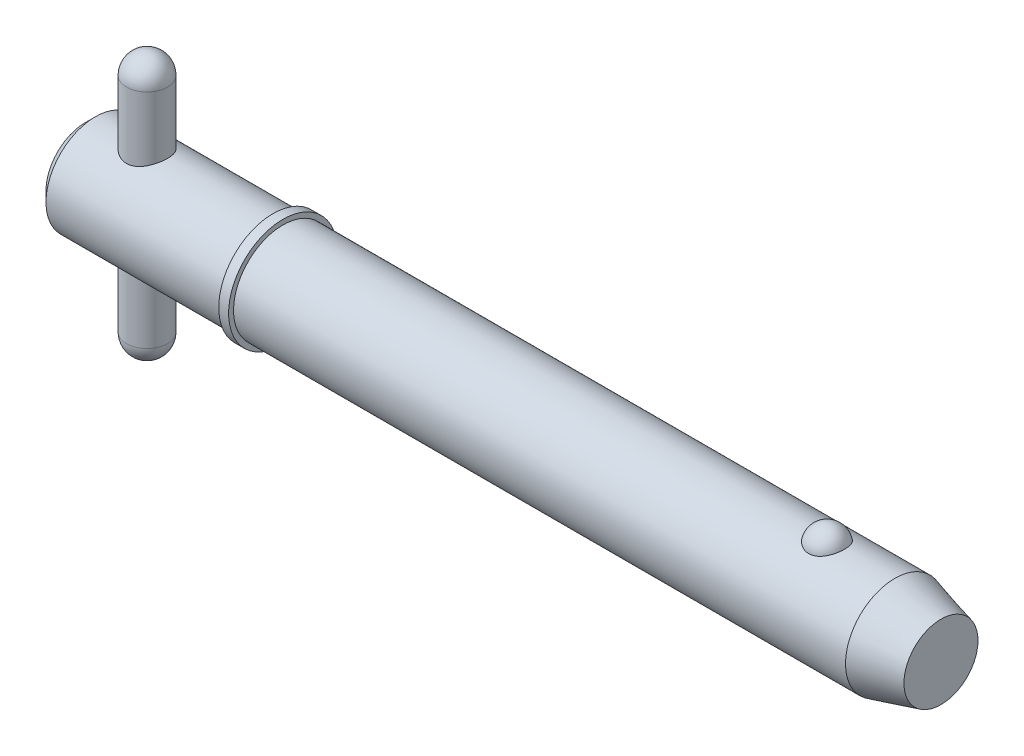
ISO-10303-21;
HEADER;
FILE_DESCRIPTION(('STEP AP214'),'2;1');
FILE_NAME('part.step','',(''),(''),'','','');
FILE_SCHEMA(('AUTOMOTIVE_DESIGN { 1 0 10303 214 1 1 1 1 }'));
ENDSEC;
DATA;
#1=APPLICATION_CONTEXT('core data for automotive mechanical design processes');
#2=APPLICATION_PROTOCOL_DEFINITION('international standard','automotive_design',2000,#1);
#3=PRODUCT_CONTEXT('',#1,'mechanical');
#4=PRODUCT('Part','Part','',(#3));
#5=PRODUCT_RELATED_PRODUCT_CATEGORY('part','',(#4));
#6=PRODUCT_DEFINITION_FORMATION('','',#4);
#7=PRODUCT_DEFINITION_CONTEXT('part definition',#1,'design');
#8=PRODUCT_DEFINITION('design','',#6,#7);
#9=PRODUCT_DEFINITION_SHAPE('','',#8);
#10=(LENGTH_UNIT() NAMED_UNIT(*) SI_UNIT(.MILLI.,.METRE.));
#11=(NAMED_UNIT(*) PLANE_ANGLE_UNIT() SI_UNIT($,.RADIAN.));
#12=(NAMED_UNIT(*) SI_UNIT($,.STERADIAN.) SOLID_ANGLE_UNIT());
#13=UNCERTAINTY_MEASURE_WITH_UNIT(LENGTH_MEASURE(1.E-05),#10,'distance_accuracy_value','');
#14=(GEOMETRIC_REPRESENTATION_CONTEXT(3) GLOBAL_UNCERTAINTY_ASSIGNED_CONTEXT((#13)) GLOBAL_UNIT_ASSIGNED_CONTEXT((#10,
#11,#12)) REPRESENTATION_CONTEXT('',''));
#15=CARTESIAN_POINT('',(0.,0.,0.));
#16=DIRECTION('',(0.,0.,1.));
#17=DIRECTION('',(1.,0.,0.));
#18=AXIS2_PLACEMENT_3D('',#15,#16,#17);
#19=CARTESIAN_POINT('',(5.94,12.7,0.));
#20=DIRECTION('',(0.,-1.,0.));
#21=DIRECTION('',(0.,0.,-1.));
#22=AXIS2_PLACEMENT_3D('',#19,#20,#21);
#23=CYLINDRICAL_SURFACE('',#22,1.98);
#24=CARTESIAN_POINT('',(5.94,-10.72,0.));
#25=DIRECTION('',(0.,-1.,0.));
#26=DIRECTION('',(0.,0.,-1.));
#27=AXIS2_PLACEMENT_3D('',#24,#25,#26);
#28=CIRCLE('',#27,1.98);
#29=CARTESIAN_POINT('',(5.94,-10.72,-1.98));
#30=VERTEX_POINT('',#29);
#31=EDGE_CURVE('P0_E10',#30,#30,#28,.F.);
#32=ORIENTED_EDGE('',*,*,#31,.T.);
#33=EDGE_LOOP('',(#32));
#34=FACE_BOUND('',#33,.T.);
#35=CARTESIAN_POINT('',(5.94,10.72,0.));
#36=DIRECTION('',(0.,-1.,0.));
#37=DIRECTION('',(0.,0.,-1.));
#38=AXIS2_PLACEMENT_3D('',#35,#36,#37);
#39=CIRCLE('',#38,1.98);
#40=CARTESIAN_POINT('',(5.94,10.72,-1.98));
#41=VERTEX_POINT('',#40);
#42=EDGE_CURVE('P0_E21',#41,#41,#39,.T.);
#43=ORIENTED_EDGE('',*,*,#42,.T.);
#44=EDGE_LOOP('',(#43));
#45=FACE_BOUND('',#44,.T.);
#46=ADVANCED_FACE('P0_F14',(#34,#45),#23,.T.);
#47=CARTESIAN_POINT('',(5.94,-10.72,0.));
#48=DIRECTION('',(0.,0.,1.));
#49=DIRECTION('',(1.,0.,0.));
#50=AXIS2_PLACEMENT_3D('',#47,#48,#49);
#51=SPHERICAL_SURFACE('',#50,1.98);
#52=CARTESIAN_POINT('',(5.94,-10.72,0.));
#53=DIRECTION('',(0.,-1.,0.));
#54=DIRECTION('',(0.,0.,-1.));
#55=AXIS2_PLACEMENT_3D('',#52,#53,#54);
#56=SPHERICAL_SURFACE('',#55,1.98);
#57=ORIENTED_EDGE('',*,*,#31,.F.);
#58=EDGE_LOOP('',(#57));
#59=FACE_BOUND('',#58,.T.);
#60=ADVANCED_FACE('P0_F29',(#59),#56,.T.);
#61=CARTESIAN_POINT('',(5.94,10.72,0.));
#62=DIRECTION('',(0.,0.,1.));
#63=DIRECTION('',(1.,0.,0.));
#64=AXIS2_PLACEMENT_3D('',#61,#62,#63);
#65=SPHERICAL_SURFACE('',#64,1.98);
#66=CARTESIAN_POINT('',(5.94,10.72,0.));
#67=DIRECTION('',(0.,-1.,0.));
#68=DIRECTION('',(0.,0.,-1.));
#69=AXIS2_PLACEMENT_3D('',#66,#67,#68);
#70=SPHERICAL_SURFACE('',#69,1.98);
#71=ORIENTED_EDGE('',*,*,#42,.F.);
#72=EDGE_LOOP('',(#71));
#73=FACE_BOUND('',#72,.T.);
#74=ADVANCED_FACE('P0_F16',(#73),#70,.T.);
#75=CLOSED_SHELL('',(#46,#60,#74));
#76=MANIFOLD_SOLID_BREP('P0_B1',#75);
#77=CARTESIAN_POINT('',(0.,0.,0.));
#78=DIRECTION('',(1.,0.,0.));
#79=DIRECTION('',(0.,0.,-1.));
#80=AXIS2_PLACEMENT_3D('',#77,#78,#79);
#81=CYLINDRICAL_SURFACE('',#80,4.765);
#82=CARTESIAN_POINT('',(78.1041944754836,0.,0.));
#83=DIRECTION('',(1.,0.,0.));
#84=DIRECTION('',(0.,0.,-1.));
#85=AXIS2_PLACEMENT_3D('',#82,#83,#84);
#86=CIRCLE('',#85,4.765);
#87=CARTESIAN_POINT('',(78.1041944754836,0.,-4.765));
#88=VERTEX_POINT('',#87);
#89=EDGE_CURVE('P1_E81',#88,#88,#86,.T.);
#90=ORIENTED_EDGE('',*,*,#89,.F.);
#91=EDGE_LOOP('',(#90));
#92=FACE_BOUND('',#91,.T.);
#93=CARTESIAN_POINT('',(19.05,0.,0.));
#94=DIRECTION('',(1.,0.,0.));
#95=DIRECTION('',(0.,0.,-1.));
#96=AXIS2_PLACEMENT_3D('',#93,#94,#95);
#97=CIRCLE('',#96,4.765);
#98=CARTESIAN_POINT('',(19.05,0.,-4.765));
#99=VERTEX_POINT('',#98);
#100=EDGE_CURVE('P1_E85',#99,#99,#97,.T.);
#101=ORIENTED_EDGE('',*,*,#100,.T.);
#102=EDGE_LOOP('',(#101));
#103=FACE_BOUND('',#102,.T.);
#104=CARTESIAN_POINT('',(71.551020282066,4.42764777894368,1.76101111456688));
#105=CARTESIAN_POINT('',(71.4597212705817,4.42764470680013,1.76101422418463));
#106=CARTESIAN_POINT('',(71.3684468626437,4.43059091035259,1.75366340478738));
#107=CARTESIAN_POINT('',(71.188615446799,4.44201846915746,1.72451180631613));
#108=CARTESIAN_POINT('',(71.1000577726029,4.45049845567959,1.70271460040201));
#109=CARTESIAN_POINT('',(70.9282570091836,4.47200516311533,1.6453937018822));
#110=CARTESIAN_POINT('',(70.8450064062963,4.48502527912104,1.60988994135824));
#111=CARTESIAN_POINT('',(70.6857633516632,4.51419542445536,1.52617873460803));
#112=CARTESIAN_POINT('',(70.6097723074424,4.53034605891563,1.47796883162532));
#113=CARTESIAN_POINT('',(70.4647445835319,4.5645931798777,1.36860494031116));
#114=CARTESIAN_POINT('',(70.3959645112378,4.58273170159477,1.30712420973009));
#115=CARTESIAN_POINT('',(70.2693423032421,4.61870302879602,1.17370204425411));
#116=CARTESIAN_POINT('',(70.2115021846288,4.63653577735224,1.1017586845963));
#117=CARTESIAN_POINT('',(70.1055709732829,4.67090140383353,0.945806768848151));
#118=CARTESIAN_POINT('',(70.0580305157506,4.68734068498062,0.861402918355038));
#119=CARTESIAN_POINT('',(69.9770817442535,4.71628466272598,0.685442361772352));
#120=CARTESIAN_POINT('',(69.9436747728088,4.72878898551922,0.59388497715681));
#121=CARTESIAN_POINT('',(69.891287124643,4.74874061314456,0.40478128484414));
#122=CARTESIAN_POINT('',(69.8725178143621,4.75611366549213,0.307168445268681));
#123=CARTESIAN_POINT('',(69.8505846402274,4.76475393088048,0.109940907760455));
#124=CARTESIAN_POINT('',(69.8474205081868,4.76602124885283,0.0103262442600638));
#125=CARTESIAN_POINT('',(69.8567405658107,4.76232928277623,-0.187629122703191));
#126=CARTESIAN_POINT('',(69.8691588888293,4.7573962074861,-0.285973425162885));
#127=CARTESIAN_POINT('',(69.9092804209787,4.74184975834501,-0.479027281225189));
#128=CARTESIAN_POINT('',(69.9369839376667,4.7312362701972,-0.573736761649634));
#129=CARTESIAN_POINT('',(70.0071581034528,4.70540026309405,-0.756973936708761));
#130=CARTESIAN_POINT('',(70.0496460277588,4.69017235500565,-0.84549425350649));
#131=CARTESIAN_POINT('',(70.148520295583,4.6566986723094,-1.01378033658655));
#132=CARTESIAN_POINT('',(70.2049076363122,4.63845268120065,-1.09354547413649));
#133=CARTESIAN_POINT('',(70.330552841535,4.60085438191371,-1.24228523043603));
#134=CARTESIAN_POINT('',(70.3998439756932,4.58149930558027,-1.31123108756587));
#135=CARTESIAN_POINT('',(70.5496066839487,4.54391653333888,-1.43607409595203));
#136=CARTESIAN_POINT('',(70.6300771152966,4.52568872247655,-1.49197257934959));
#137=CARTESIAN_POINT('',(70.7981500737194,4.49293007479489,-1.58786764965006));
#138=CARTESIAN_POINT('',(70.8855445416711,4.47832346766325,-1.62820219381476));
#139=CARTESIAN_POINT('',(71.066553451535,4.45406011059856,-1.69345757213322));
#140=CARTESIAN_POINT('',(71.1601655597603,4.44440151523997,-1.71838415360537));
#141=CARTESIAN_POINT('',(71.3458939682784,4.43159888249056,-1.75112843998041));
#142=CARTESIAN_POINT('',(71.437849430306,4.42815213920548,-1.75974223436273));
#143=CARTESIAN_POINT('',(71.6219658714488,4.427247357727,-1.76201865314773));
#144=CARTESIAN_POINT('',(71.7141268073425,4.42978816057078,-1.7556841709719));
#145=CARTESIAN_POINT('',(71.8931292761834,4.4403864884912,-1.72869560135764));
#146=CARTESIAN_POINT('',(71.9800474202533,4.44827555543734,-1.70847853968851));
#147=CARTESIAN_POINT('',(72.1491314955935,4.46852246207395,-1.65479562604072));
#148=CARTESIAN_POINT('',(72.2312970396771,4.48088066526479,-1.62132869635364));
#149=CARTESIAN_POINT('',(72.3905916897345,4.50907357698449,-1.54120560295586));
#150=CARTESIAN_POINT('',(72.4675700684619,4.52497884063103,-1.49427526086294));
#151=CARTESIAN_POINT('',(72.6127080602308,4.55845148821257,-1.38881222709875));
#152=CARTESIAN_POINT('',(72.6808656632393,4.57601924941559,-1.33027689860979));
#153=CARTESIAN_POINT('',(72.8100990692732,4.61196537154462,-1.19991049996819));
#154=CARTESIAN_POINT('',(72.8706562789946,4.63034074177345,-1.12756415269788));
#155=CARTESIAN_POINT('',(72.9792797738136,4.66513959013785,-0.973612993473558));
#156=CARTESIAN_POINT('',(73.0273438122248,4.68156271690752,-0.892006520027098));
#157=CARTESIAN_POINT('',(73.111383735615,4.71130224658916,-0.718892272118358));
#158=CARTESIAN_POINT('',(73.1469185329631,4.724501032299,-0.627149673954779));
#159=CARTESIAN_POINT('',(73.2029522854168,4.74571823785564,-0.43861154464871));
#160=CARTESIAN_POINT('',(73.223450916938,4.75373654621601,-0.341815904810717));
#161=CARTESIAN_POINT('',(73.2490338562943,4.76378905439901,-0.145633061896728));
#162=CARTESIAN_POINT('',(73.254076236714,4.76580697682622,-0.0462395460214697));
#163=CARTESIAN_POINT('',(73.2485239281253,4.76360573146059,0.152038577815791));
#164=CARTESIAN_POINT('',(73.2379294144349,4.75938663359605,0.250923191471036));
#165=CARTESIAN_POINT('',(73.2013875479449,4.74516937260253,0.445004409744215));
#166=CARTESIAN_POINT('',(73.1754964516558,4.73519238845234,0.540213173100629));
#167=CARTESIAN_POINT('',(73.1089273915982,4.7104939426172,0.724662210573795));
#168=CARTESIAN_POINT('',(73.068248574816,4.69577220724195,0.813902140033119));
#169=CARTESIAN_POINT('',(72.9727177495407,4.66303767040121,0.984313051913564));
#170=CARTESIAN_POINT('',(72.9178042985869,4.64501070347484,1.06544688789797));
#171=CARTESIAN_POINT('',(72.7950496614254,4.60764678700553,1.21692673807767));
#172=CARTESIAN_POINT('',(72.7272086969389,4.58830985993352,1.2872729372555));
#173=CARTESIAN_POINT('',(72.5805480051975,4.55060370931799,1.41479271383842));
#174=CARTESIAN_POINT('',(72.5017918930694,4.53222967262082,1.47203785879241));
#175=CARTESIAN_POINT('',(72.3349890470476,4.49849576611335,1.57212016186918));
#176=CARTESIAN_POINT('',(72.2469417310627,4.48313608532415,1.61495641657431));
#177=CARTESIAN_POINT('',(72.0597918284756,4.45676184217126,1.68642657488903));
#178=CARTESIAN_POINT('',(71.9603653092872,4.44598302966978,1.71430590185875));
#179=CARTESIAN_POINT('',(71.7576210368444,4.43142918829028,1.75159258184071));
#180=CARTESIAN_POINT('',(71.6543049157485,4.42765125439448,1.76100759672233));
#181=CARTESIAN_POINT('',(71.551020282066,4.42764777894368,1.76101111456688));
#182=B_SPLINE_CURVE_WITH_KNOTS('',3,(#104,#105,#106,#107,#108,#109,#110,#111,#112,#113,#114,
#115,#116,#117,#118,#119,#120,#121,#122,#123,#124,#125,#126,#127,#128,#129,#130,#131,#132,#133,
#134,#135,#136,#137,#138,#139,#140,#141,#142,#143,#144,#145,#146,#147,#148,#149,#150,#151,#152,
#153,#154,#155,#156,#157,#158,#159,#160,#161,#162,#163,#164,#165,#166,#167,#168,#169,#170,#171,
#172,#173,#174,#175,#176,#177,#178,#179,#180,#181),.UNSPECIFIED.,.T.,.F.,(4,2,2,2,2,2,2,2,2,2,2,
2,2,2,2,2,2,2,2,2,2,2,2,2,2,2,2,2,2,2,2,2,2,2,2,2,2,2,4),(0.,0.273517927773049,
0.546968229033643,0.820022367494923,1.09312934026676,1.37393946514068,1.65480131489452,
1.94820420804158,2.24163496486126,2.53922817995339,2.8368162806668,3.13315071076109,
3.42949110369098,3.72617893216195,4.02288805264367,4.32037303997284,4.61782764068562,
4.9084009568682,5.19886582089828,5.4747485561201,5.75057789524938,6.01809977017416,
6.2856434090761,6.55907787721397,6.83257454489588,7.11962987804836,7.40673679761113,
7.70312663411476,7.99952284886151,8.29672237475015,8.59391856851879,8.89002850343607,
9.18615552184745,9.483582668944,9.78100471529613,10.0767610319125,10.3725358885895,
10.6820893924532,10.991514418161),.UNSPECIFIED.);
#183=CARTESIAN_POINT('',(71.551020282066,4.42764777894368,1.76101111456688));
#184=VERTEX_POINT('',#183);
#185=EDGE_CURVE('P1_E35',#184,#184,#182,.T.);
#186=ORIENTED_EDGE('',*,*,#185,.T.);
#187=EDGE_LOOP('',(#186));
#188=FACE_BOUND('',#187,.T.);
#189=ADVANCED_FACE('P1_F13',(#92,#103,#188),#81,.T.);
#190=CARTESIAN_POINT('',(0.,0.,0.));
#191=DIRECTION('',(-1.,0.,0.));
#192=DIRECTION('',(0.,0.,1.));
#193=AXIS2_PLACEMENT_3D('',#190,#191,#192);
#194=PLANE('',#193);
#195=CARTESIAN_POINT('',(0.,0.,0.));
#196=DIRECTION('',(1.,0.,0.));
#197=DIRECTION('',(0.,0.,-1.));
#198=AXIS2_PLACEMENT_3D('',#195,#196,#197);
#199=CIRCLE('',#198,3.812);
#200=CARTESIAN_POINT('',(0.,0.,-3.812));
#201=VERTEX_POINT('',#200);
#202=EDGE_CURVE('P1_E9',#201,#201,#199,.T.);
#203=ORIENTED_EDGE('',*,*,#202,.F.);
#204=EDGE_LOOP('',(#203));
#205=FACE_BOUND('',#204,.T.);
#206=ADVANCED_FACE('P1_F15',(#205),#194,.T.);
#207=CARTESIAN_POINT('',(0.952999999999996,0.,0.));
#208=DIRECTION('',(1.,0.,0.));
#209=DIRECTION('',(0.,0.,-1.));
#210=AXIS2_PLACEMENT_3D('',#207,#208,#209);
#211=CONICAL_SURFACE('',#210,4.765,0.78539816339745);
#212=ORIENTED_EDGE('',*,*,#202,.T.);
#213=EDGE_LOOP('',(#212));
#214=FACE_BOUND('',#213,.T.);
#215=CARTESIAN_POINT('',(0.952999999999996,0.,0.));
#216=DIRECTION('',(1.,0.,0.));
#217=DIRECTION('',(0.,0.,-1.));
#218=AXIS2_PLACEMENT_3D('',#215,#216,#217);
#219=CIRCLE('',#218,4.765);
#220=CARTESIAN_POINT('',(0.952999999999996,0.,-4.765));
#221=VERTEX_POINT('',#220);
#222=EDGE_CURVE('P1_E26',#221,#221,#219,.T.);
#223=ORIENTED_EDGE('',*,*,#222,.F.);
#224=EDGE_LOOP('',(#223));
#225=FACE_BOUND('',#224,.T.);
#226=ADVANCED_FACE('P1_F77',(#214,#225),#211,.T.);
#227=CARTESIAN_POINT('',(0.,0.,0.));
#228=DIRECTION('',(1.,0.,0.));
#229=DIRECTION('',(0.,0.,-1.));
#230=AXIS2_PLACEMENT_3D('',#227,#228,#229);
#231=CYLINDRICAL_SURFACE('',#230,4.765);
#232=CARTESIAN_POINT('',(5.94,-4.33414639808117,1.98));
#233=CARTESIAN_POINT('',(5.83435484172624,-4.33415447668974,1.97999169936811));
#234=CARTESIAN_POINT('',(5.72854887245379,-4.33806396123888,1.97149330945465));
#235=CARTESIAN_POINT('',(5.51998191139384,-4.35319906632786,1.93783487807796));
#236=CARTESIAN_POINT('',(5.41723000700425,-4.3644446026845,1.91262947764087));
#237=CARTESIAN_POINT('',(5.21817294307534,-4.39274225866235,1.84670269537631));
#238=CARTESIAN_POINT('',(5.12184344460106,-4.40977076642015,1.80604432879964));
#239=CARTESIAN_POINT('',(4.93740039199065,-4.44768106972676,1.71055160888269));
#240=CARTESIAN_POINT('',(4.84928487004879,-4.46856193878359,1.65572066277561));
#241=CARTESIAN_POINT('',(4.67826533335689,-4.51326966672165,1.52981120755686));
#242=CARTESIAN_POINT('',(4.59593118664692,-4.53719608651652,1.45799365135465));
#243=CARTESIAN_POINT('',(4.44405452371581,-4.58448035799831,1.30170177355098));
#244=CARTESIAN_POINT('',(4.37451692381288,-4.60783798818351,1.21722260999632));
#245=CARTESIAN_POINT('',(4.24730683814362,-4.65256187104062,1.03353484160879));
#246=CARTESIAN_POINT('',(4.19027484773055,-4.67379892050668,0.933848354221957));
#247=CARTESIAN_POINT('',(4.0940363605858,-4.7106711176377,0.7252544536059));
#248=CARTESIAN_POINT('',(4.05482199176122,-4.72630873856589,0.61635113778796));
#249=CARTESIAN_POINT('',(3.99739515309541,-4.74951416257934,0.398397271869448));
#250=CARTESIAN_POINT('',(3.97820018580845,-4.7574579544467,0.289646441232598));
#251=CARTESIAN_POINT('',(3.95818309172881,-4.76574596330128,0.0701967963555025));
#252=CARTESIAN_POINT('',(3.95735355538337,-4.76609324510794,-0.0405012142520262));
#253=CARTESIAN_POINT('',(3.9735743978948,-4.75937098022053,-0.253561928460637));
#254=CARTESIAN_POINT('',(3.98954548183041,-4.75274912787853,-0.356023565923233));
#255=CARTESIAN_POINT('',(4.03706504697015,-4.73344665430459,-0.556659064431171));
#256=CARTESIAN_POINT('',(4.06861467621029,-4.72076558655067,-0.654832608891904));
#257=CARTESIAN_POINT('',(4.14677192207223,-4.69032846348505,-0.845904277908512));
#258=CARTESIAN_POINT('',(4.19360181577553,-4.67249797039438,-0.938699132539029));
#259=CARTESIAN_POINT('',(4.30077315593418,-4.63350852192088,-1.11535616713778));
#260=CARTESIAN_POINT('',(4.3611193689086,-4.61234839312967,-1.19921518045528));
#261=CARTESIAN_POINT('',(4.49853487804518,-4.56707259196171,-1.3618711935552));
#262=CARTESIAN_POINT('',(4.57648039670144,-4.5428537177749,-1.43990029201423));
#263=CARTESIAN_POINT('',(4.74440779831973,-4.49530722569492,-1.58211009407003));
#264=CARTESIAN_POINT('',(4.83439425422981,-4.47197995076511,-1.64628551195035));
#265=CARTESIAN_POINT('',(5.02755026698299,-4.42812342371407,-1.76092221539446));
#266=CARTESIAN_POINT('',(5.13105348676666,-4.40770990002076,-1.81086937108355));
#267=CARTESIAN_POINT('',(5.34607555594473,-4.37336901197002,-1.89231211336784));
#268=CARTESIAN_POINT('',(5.45758864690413,-4.3594370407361,-1.92382080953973));
#269=CARTESIAN_POINT('',(5.67777275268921,-4.34077746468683,-1.96554536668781));
#270=CARTESIAN_POINT('',(5.78616167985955,-4.33551319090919,-1.9770057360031));
#271=CARTESIAN_POINT('',(6.00341835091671,-4.33325118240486,-1.98196183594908));
#272=CARTESIAN_POINT('',(6.11228591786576,-4.33625061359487,-1.97546372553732));
#273=CARTESIAN_POINT('',(6.32012423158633,-4.34962383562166,-1.94582288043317));
#274=CARTESIAN_POINT('',(6.41928436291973,-4.35951709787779,-1.92376364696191));
#275=CARTESIAN_POINT('',(6.61241543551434,-4.38495043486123,-1.86506038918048));
#276=CARTESIAN_POINT('',(6.70638516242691,-4.40049182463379,-1.82841296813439));
#277=CARTESIAN_POINT('',(6.89090272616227,-4.43627016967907,-1.73985559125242));
#278=CARTESIAN_POINT('',(6.98113841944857,-4.45667771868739,-1.68736639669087));
#279=CARTESIAN_POINT('',(7.1519532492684,-4.49964530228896,-1.56919282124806));
#280=CARTESIAN_POINT('',(7.232528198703,-4.52220626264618,-1.50350275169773));
#281=CARTESIAN_POINT('',(7.38851617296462,-4.56914071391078,-1.35452895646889));
#282=CARTESIAN_POINT('',(7.46298462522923,-4.5935132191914,-1.27025197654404));
#283=CARTESIAN_POINT('',(7.59689029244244,-4.63962841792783,-1.08983181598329));
#284=CARTESIAN_POINT('',(7.65632644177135,-4.66137092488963,-0.993687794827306));
#285=CARTESIAN_POINT('',(7.75840361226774,-4.69991192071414,-0.791608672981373));
#286=CARTESIAN_POINT('',(7.80100481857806,-4.71669866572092,-0.685651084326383));
#287=CARTESIAN_POINT('',(7.86746997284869,-4.74331408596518,-0.467197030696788));
#288=CARTESIAN_POINT('',(7.8913450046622,-4.75314687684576,-0.354704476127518));
#289=CARTESIAN_POINT('',(7.91828971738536,-4.76427543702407,-0.134819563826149));
#290=CARTESIAN_POINT('',(7.92269147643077,-4.76611762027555,-0.027616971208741));
#291=CARTESIAN_POINT('',(7.91414154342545,-4.76256684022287,0.185959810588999));
#292=CARTESIAN_POINT('',(7.90119286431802,-4.75717513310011,0.292334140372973));
#293=CARTESIAN_POINT('',(7.85926572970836,-4.74004856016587,0.497383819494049));
#294=CARTESIAN_POINT('',(7.83086647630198,-4.72854322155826,0.596198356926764));
#295=CARTESIAN_POINT('',(7.75947503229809,-4.70045111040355,0.787624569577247));
#296=CARTESIAN_POINT('',(7.71648006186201,-4.68386336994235,0.880235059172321));
#297=CARTESIAN_POINT('',(7.6149456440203,-4.64628321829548,1.06122875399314));
#298=CARTESIAN_POINT('',(7.55579211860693,-4.62512577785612,1.14923242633));
#299=CARTESIAN_POINT('',(7.42451813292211,-4.58091700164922,1.31443888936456));
#300=CARTESIAN_POINT('',(7.35239289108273,-4.5578649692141,1.39163767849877));
#301=CARTESIAN_POINT('',(7.19146107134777,-4.51050832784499,1.53847013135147));
#302=CARTESIAN_POINT('',(7.10185635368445,-4.48622440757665,1.60723941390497));
#303=CARTESIAN_POINT('',(6.91164948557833,-4.44076541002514,1.72888900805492));
#304=CARTESIAN_POINT('',(6.81104124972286,-4.41959206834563,1.78176046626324));
#305=CARTESIAN_POINT('',(6.60181953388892,-4.38318936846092,1.86953227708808));
#306=CARTESIAN_POINT('',(6.49325511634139,-4.3679267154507,1.90453365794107));
#307=CARTESIAN_POINT('',(6.32681512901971,-4.35102038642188,1.94268459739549));
#308=CARTESIAN_POINT('',(6.27079191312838,-4.34638447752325,1.953006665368));
#309=CARTESIAN_POINT('',(6.15793999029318,-4.33925923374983,1.96879053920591));
#310=CARTESIAN_POINT('',(6.10111188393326,-4.33676837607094,1.97425579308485));
#311=CARTESIAN_POINT('',(6.00947316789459,-4.33456308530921,1.97908711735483));
#312=CARTESIAN_POINT('',(5.97474528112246,-4.33414374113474,1.98000272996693));
#313=CARTESIAN_POINT('',(5.94,-4.33414639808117,1.98));
#314=B_SPLINE_CURVE_WITH_KNOTS('',3,(#232,#233,#234,#235,#236,#237,#238,#239,#240,#241,#242,
#243,#244,#245,#246,#247,#248,#249,#250,#251,#252,#253,#254,#255,#256,#257,#258,#259,#260,#261,
#262,#263,#264,#265,#266,#267,#268,#269,#270,#271,#272,#273,#274,#275,#276,#277,#278,#279,#280,
#281,#282,#283,#284,#285,#286,#287,#288,#289,#290,#291,#292,#293,#294,#295,#296,#297,#298,#299,
#300,#301,#302,#303,#304,#305,#306,#307,#308,#309,#310,#311,#312,#313),.UNSPECIFIED.,.T.,.F.,(4,
2,2,2,2,2,2,2,2,2,2,2,2,2,2,2,2,2,2,2,2,2,2,2,2,2,2,2,2,2,2,2,2,2,2,2,2,2,2,2,4),(0.,
0.316814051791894,0.634491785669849,0.950887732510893,1.2672076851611,1.60127705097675,
1.93547449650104,2.28407463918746,2.63252061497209,2.96292077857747,3.29318763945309,
3.60346227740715,3.91375978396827,4.22878888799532,4.54392926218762,4.88117914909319,
5.21855748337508,5.56691259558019,5.91501972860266,6.24062939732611,6.56612741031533,
6.87094948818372,7.17584258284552,7.49361276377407,7.81152017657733,8.15513975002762,
8.4987836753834,8.8432355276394,9.18748334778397,9.50777781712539,9.8280166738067,
10.1370037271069,10.4460496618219,10.7690461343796,11.0921619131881,11.4371238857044,
11.7822776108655,12.1254577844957,12.2967183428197,12.4678572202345,12.5720531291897),.UNSPECIFIED.);
#315=CARTESIAN_POINT('',(5.94,-4.33414639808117,1.98));
#316=VERTEX_POINT('',#315);
#317=EDGE_CURVE('P1_E17',#316,#316,#314,.T.);
#318=ORIENTED_EDGE('',*,*,#317,.F.);
#319=EDGE_LOOP('',(#318));
#320=FACE_BOUND('',#319,.T.);
#321=CARTESIAN_POINT('',(5.94,4.33414639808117,1.98));
#322=CARTESIAN_POINT('',(6.04564515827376,4.33415447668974,1.97999169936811));
#323=CARTESIAN_POINT('',(6.15145112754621,4.33806396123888,1.97149330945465));
#324=CARTESIAN_POINT('',(6.36001808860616,4.35319906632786,1.93783487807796));
#325=CARTESIAN_POINT('',(6.46276999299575,4.3644446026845,1.91262947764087));
#326=CARTESIAN_POINT('',(6.66182705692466,4.39274225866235,1.84670269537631));
#327=CARTESIAN_POINT('',(6.75815655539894,4.40977076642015,1.80604432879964));
#328=CARTESIAN_POINT('',(6.94259960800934,4.44768106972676,1.71055160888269));
#329=CARTESIAN_POINT('',(7.03071512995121,4.46856193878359,1.65572066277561));
#330=CARTESIAN_POINT('',(7.20173466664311,4.51326966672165,1.52981120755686));
#331=CARTESIAN_POINT('',(7.28406881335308,4.53719608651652,1.45799365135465));
#332=CARTESIAN_POINT('',(7.43594547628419,4.58448035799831,1.30170177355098));
#333=CARTESIAN_POINT('',(7.50548307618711,4.60783798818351,1.21722260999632));
#334=CARTESIAN_POINT('',(7.63269316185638,4.65256187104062,1.03353484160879));
#335=CARTESIAN_POINT('',(7.68972515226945,4.67379892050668,0.933848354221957));
#336=CARTESIAN_POINT('',(7.7859636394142,4.7106711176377,0.7252544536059));
#337=CARTESIAN_POINT('',(7.82517800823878,4.72630873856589,0.61635113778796));
#338=CARTESIAN_POINT('',(7.88260484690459,4.74951416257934,0.398397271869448));
#339=CARTESIAN_POINT('',(7.90179981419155,4.7574579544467,0.289646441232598));
#340=CARTESIAN_POINT('',(7.92181690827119,4.76574596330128,0.0701967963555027));
#341=CARTESIAN_POINT('',(7.92264644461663,4.76609324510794,-0.040501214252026));
#342=CARTESIAN_POINT('',(7.9064256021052,4.75937098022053,-0.253561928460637));
#343=CARTESIAN_POINT('',(7.89045451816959,4.75274912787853,-0.356023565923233));
#344=CARTESIAN_POINT('',(7.84293495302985,4.73344665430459,-0.55665906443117));
#345=CARTESIAN_POINT('',(7.81138532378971,4.72076558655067,-0.654832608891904));
#346=CARTESIAN_POINT('',(7.73322807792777,4.69032846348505,-0.845904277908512));
#347=CARTESIAN_POINT('',(7.68639818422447,4.67249797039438,-0.938699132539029));
#348=CARTESIAN_POINT('',(7.57922684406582,4.63350852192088,-1.11535616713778));
#349=CARTESIAN_POINT('',(7.5188806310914,4.61234839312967,-1.19921518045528));
#350=CARTESIAN_POINT('',(7.38146512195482,4.56707259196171,-1.3618711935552));
#351=CARTESIAN_POINT('',(7.30351960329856,4.5428537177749,-1.43990029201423));
#352=CARTESIAN_POINT('',(7.13559220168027,4.49530722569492,-1.58211009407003));
#353=CARTESIAN_POINT('',(7.04560574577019,4.47197995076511,-1.64628551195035));
#354=CARTESIAN_POINT('',(6.85244973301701,4.42812342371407,-1.76092221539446));
#355=CARTESIAN_POINT('',(6.74894651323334,4.40770990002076,-1.81086937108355));
#356=CARTESIAN_POINT('',(6.53392444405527,4.37336901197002,-1.89231211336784));
#357=CARTESIAN_POINT('',(6.42241135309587,4.3594370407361,-1.92382080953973));
#358=CARTESIAN_POINT('',(6.20222724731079,4.34077746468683,-1.96554536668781));
#359=CARTESIAN_POINT('',(6.09383832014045,4.33551319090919,-1.9770057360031));
#360=CARTESIAN_POINT('',(5.87658164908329,4.33325118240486,-1.98196183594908));
#361=CARTESIAN_POINT('',(5.76771408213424,4.33625061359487,-1.97546372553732));
#362=CARTESIAN_POINT('',(5.55987576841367,4.34962383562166,-1.94582288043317));
#363=CARTESIAN_POINT('',(5.46071563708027,4.35951709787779,-1.92376364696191));
#364=CARTESIAN_POINT('',(5.26758456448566,4.38495043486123,-1.86506038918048));
#365=CARTESIAN_POINT('',(5.17361483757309,4.40049182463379,-1.82841296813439));
#366=CARTESIAN_POINT('',(4.98909727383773,4.43627016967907,-1.73985559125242));
#367=CARTESIAN_POINT('',(4.89886158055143,4.45667771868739,-1.68736639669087));
#368=CARTESIAN_POINT('',(4.72804675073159,4.49964530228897,-1.56919282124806));
#369=CARTESIAN_POINT('',(4.647471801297,4.52220626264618,-1.50350275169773));
#370=CARTESIAN_POINT('',(4.49148382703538,4.56914071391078,-1.35452895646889));
#371=CARTESIAN_POINT('',(4.41701537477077,4.5935132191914,-1.27025197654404));
#372=CARTESIAN_POINT('',(4.28310970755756,4.63962841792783,-1.08983181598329));
#373=CARTESIAN_POINT('',(4.22367355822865,4.66137092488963,-0.993687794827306));
#374=CARTESIAN_POINT('',(4.12159638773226,4.69991192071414,-0.791608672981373));
#375=CARTESIAN_POINT('',(4.07899518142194,4.71669866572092,-0.685651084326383));
#376=CARTESIAN_POINT('',(4.01253002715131,4.74331408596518,-0.467197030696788));
#377=CARTESIAN_POINT('',(3.98865499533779,4.75314687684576,-0.354704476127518));
#378=CARTESIAN_POINT('',(3.96171028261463,4.76427543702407,-0.134819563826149));
#379=CARTESIAN_POINT('',(3.95730852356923,4.76611762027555,-0.0276169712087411));
#380=CARTESIAN_POINT('',(3.96585845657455,4.76256684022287,0.185959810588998));
#381=CARTESIAN_POINT('',(3.97880713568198,4.75717513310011,0.292334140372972));
#382=CARTESIAN_POINT('',(4.02073427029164,4.74004856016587,0.497383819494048));
#383=CARTESIAN_POINT('',(4.04913352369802,4.72854322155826,0.596198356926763));
#384=CARTESIAN_POINT('',(4.12052496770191,4.70045111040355,0.787624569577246));
#385=CARTESIAN_POINT('',(4.16351993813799,4.68386336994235,0.880235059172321));
#386=CARTESIAN_POINT('',(4.2650543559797,4.64628321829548,1.06122875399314));
#387=CARTESIAN_POINT('',(4.32420788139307,4.62512577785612,1.14923242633));
#388=CARTESIAN_POINT('',(4.45548186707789,4.58091700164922,1.31443888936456));
#389=CARTESIAN_POINT('',(4.52760710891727,4.5578649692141,1.39163767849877));
#390=CARTESIAN_POINT('',(4.68853892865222,4.51050832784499,1.53847013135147));
#391=CARTESIAN_POINT('',(4.77814364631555,4.48622440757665,1.60723941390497));
#392=CARTESIAN_POINT('',(4.96835051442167,4.44076541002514,1.72888900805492));
#393=CARTESIAN_POINT('',(5.06895875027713,4.41959206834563,1.78176046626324));
#394=CARTESIAN_POINT('',(5.27818046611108,4.38318936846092,1.86953227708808));
#395=CARTESIAN_POINT('',(5.38674488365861,4.3679267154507,1.90453365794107));
#396=CARTESIAN_POINT('',(5.55318487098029,4.35102038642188,1.94268459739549));
#397=CARTESIAN_POINT('',(5.60920808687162,4.34638447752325,1.953006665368));
#398=CARTESIAN_POINT('',(5.72206000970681,4.33925923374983,1.96879053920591));
#399=CARTESIAN_POINT('',(5.77888811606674,4.33676837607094,1.97425579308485));
#400=CARTESIAN_POINT('',(5.87052683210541,4.33456308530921,1.97908711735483));
#401=CARTESIAN_POINT('',(5.90525471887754,4.33414374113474,1.98000272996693));
#402=CARTESIAN_POINT('',(5.94,4.33414639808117,1.98));
#403=B_SPLINE_CURVE_WITH_KNOTS('',3,(#321,#322,#323,#324,#325,#326,#327,#328,#329,#330,#331,
#332,#333,#334,#335,#336,#337,#338,#339,#340,#341,#342,#343,#344,#345,#346,#347,#348,#349,#350,
#351,#352,#353,#354,#355,#356,#357,#358,#359,#360,#361,#362,#363,#364,#365,#366,#367,#368,#369,
#370,#371,#372,#373,#374,#375,#376,#377,#378,#379,#380,#381,#382,#383,#384,#385,#386,#387,#388,
#389,#390,#391,#392,#393,#394,#395,#396,#397,#398,#399,#400,#401,#402),.UNSPECIFIED.,.T.,.F.,(4,
2,2,2,2,2,2,2,2,2,2,2,2,2,2,2,2,2,2,2,2,2,2,2,2,2,2,2,2,2,2,2,2,2,2,2,2,2,2,2,4),(0.,
0.316814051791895,0.634491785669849,0.950887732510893,1.2672076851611,1.60127705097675,
1.93547449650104,2.28407463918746,2.63252061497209,2.96292077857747,3.29318763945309,
3.60346227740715,3.91375978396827,4.22878888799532,4.54392926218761,4.88117914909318,
5.21855748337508,5.56691259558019,5.91501972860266,6.24062939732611,6.56612741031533,
6.87094948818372,7.17584258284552,7.49361276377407,7.81152017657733,8.15513975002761,
8.4987836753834,8.84323552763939,9.18748334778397,9.50777781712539,9.8280166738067,
10.1370037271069,10.4460496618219,10.7690461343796,11.0921619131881,11.4371238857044,
11.7822776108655,12.1254577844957,12.2967183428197,12.4678572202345,12.5720531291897),.UNSPECIFIED.);
#404=CARTESIAN_POINT('',(5.94,4.33414639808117,1.98));
#405=VERTEX_POINT('',#404);
#406=EDGE_CURVE('P1_E43',#405,#405,#403,.T.);
#407=ORIENTED_EDGE('',*,*,#406,.F.);
#408=EDGE_LOOP('',(#407));
#409=FACE_BOUND('',#408,.T.);
#410=ORIENTED_EDGE('',*,*,#222,.T.);
#411=EDGE_LOOP('',(#410));
#412=FACE_BOUND('',#411,.T.);
#413=CARTESIAN_POINT('',(18.097,0.,0.));
#414=DIRECTION('',(1.,0.,0.));
#415=DIRECTION('',(0.,0.,-1.));
#416=AXIS2_PLACEMENT_3D('',#413,#414,#415);
#417=CIRCLE('',#416,4.765);
#418=CARTESIAN_POINT('',(18.097,0.,-4.765));
#419=VERTEX_POINT('',#418);
#420=EDGE_CURVE('P1_E31',#419,#419,#417,.T.);
#421=ORIENTED_EDGE('',*,*,#420,.F.);
#422=EDGE_LOOP('',(#421));
#423=FACE_BOUND('',#422,.T.);
#424=ADVANCED_FACE('P1_F103',(#320,#409,#412,#423),#231,.T.);
#425=CARTESIAN_POINT('',(18.097,4.765,0.));
#426=DIRECTION('',(-1.,0.,0.));
#427=DIRECTION('',(0.,0.,1.));
#428=AXIS2_PLACEMENT_3D('',#425,#426,#427);
#429=PLANE('',#428);
#430=ORIENTED_EDGE('',*,*,#420,.T.);
#431=EDGE_LOOP('',(#430));
#432=FACE_BOUND('',#431,.T.);
#433=CARTESIAN_POINT('',(18.097,0.,0.));
#434=DIRECTION('',(1.,0.,0.));
#435=DIRECTION('',(0.,0.,-1.));
#436=AXIS2_PLACEMENT_3D('',#433,#434,#435);
#437=CIRCLE('',#436,5.2415);
#438=CARTESIAN_POINT('',(18.097,0.,-5.2415));
#439=VERTEX_POINT('',#438);
#440=EDGE_CURVE('P1_E91',#439,#439,#437,.T.);
#441=ORIENTED_EDGE('',*,*,#440,.F.);
#442=EDGE_LOOP('',(#441));
#443=FACE_BOUND('',#442,.T.);
#444=ADVANCED_FACE('P1_F100',(#432,#443),#429,.T.);
#445=CARTESIAN_POINT('',(0.,0.,0.));
#446=DIRECTION('',(1.,0.,0.));
#447=DIRECTION('',(0.,0.,-1.));
#448=AXIS2_PLACEMENT_3D('',#445,#446,#447);
#449=CYLINDRICAL_SURFACE('',#448,5.2415);
#450=ORIENTED_EDGE('',*,*,#440,.T.);
#451=EDGE_LOOP('',(#450));
#452=FACE_BOUND('',#451,.T.);
#453=CARTESIAN_POINT('',(19.05,0.,0.));
#454=DIRECTION('',(1.,0.,0.));
#455=DIRECTION('',(0.,0.,-1.));
#456=AXIS2_PLACEMENT_3D('',#453,#454,#455);
#457=CIRCLE('',#456,5.2415);
#458=CARTESIAN_POINT('',(19.05,0.,-5.2415));
#459=VERTEX_POINT('',#458);
#460=EDGE_CURVE('P1_E88',#459,#459,#457,.T.);
#461=ORIENTED_EDGE('',*,*,#460,.F.);
#462=EDGE_LOOP('',(#461));
#463=FACE_BOUND('',#462,.T.);
#464=ADVANCED_FACE('P1_F68',(#452,#463),#449,.T.);
#465=CARTESIAN_POINT('',(19.05,5.2415,0.));
#466=DIRECTION('',(1.,0.,0.));
#467=DIRECTION('',(0.,0.,-1.));
#468=AXIS2_PLACEMENT_3D('',#465,#466,#467);
#469=PLANE('',#468);
#470=ORIENTED_EDGE('',*,*,#460,.T.);
#471=EDGE_LOOP('',(#470));
#472=FACE_BOUND('',#471,.T.);
#473=ORIENTED_EDGE('',*,*,#100,.F.);
#474=EDGE_LOOP('',(#473));
#475=FACE_BOUND('',#474,.T.);
#476=ADVANCED_FACE('P1_F62',(#472,#475),#469,.T.);
#477=CARTESIAN_POINT('',(82.55,0.,0.));
#478=DIRECTION('',(-1.,0.,0.));
#479=DIRECTION('',(0.,0.,1.));
#480=AXIS2_PLACEMENT_3D('',#477,#478,#479);
#481=CONICAL_SURFACE('',#480,3.57375000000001,0.261799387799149);
#482=ORIENTED_EDGE('',*,*,#89,.T.);
#483=EDGE_LOOP('',(#482));
#484=FACE_BOUND('',#483,.T.);
#485=CARTESIAN_POINT('',(82.55,0.,0.));
#486=DIRECTION('',(1.,0.,0.));
#487=DIRECTION('',(0.,0.,-1.));
#488=AXIS2_PLACEMENT_3D('',#485,#486,#487);
#489=CIRCLE('',#488,3.57375000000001);
#490=CARTESIAN_POINT('',(82.55,0.,-3.57375000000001));
#491=VERTEX_POINT('',#490);
#492=EDGE_CURVE('P1_E42',#491,#491,#489,.T.);
#493=ORIENTED_EDGE('',*,*,#492,.F.);
#494=EDGE_LOOP('',(#493));
#495=FACE_BOUND('',#494,.T.);
#496=ADVANCED_FACE('P1_F59',(#484,#495),#481,.T.);
#497=CARTESIAN_POINT('',(82.55,3.57375000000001,0.));
#498=DIRECTION('',(1.,0.,0.));
#499=DIRECTION('',(0.,0.,-1.));
#500=AXIS2_PLACEMENT_3D('',#497,#498,#499);
#501=PLANE('',#500);
#502=ORIENTED_EDGE('',*,*,#492,.T.);
#503=EDGE_LOOP('',(#502));
#504=FACE_BOUND('',#503,.T.);
#505=ADVANCED_FACE('P1_F55',(#504),#501,.T.);
#506=CARTESIAN_POINT('',(71.551020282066,4.2885,0.));
#507=DIRECTION('',(-1.,0.,0.));
#508=DIRECTION('',(0.,1.,0.));
#509=AXIS2_PLACEMENT_3D('',#506,#507,#508);
#510=SPHERICAL_SURFACE('',#509,1.7665);
#511=ORIENTED_EDGE('',*,*,#185,.F.);
#512=EDGE_LOOP('',(#511));
#513=FACE_BOUND('',#512,.T.);
#514=ADVANCED_FACE('P1_F50',(#513),#510,.T.);
#515=CARTESIAN_POINT('',(5.94,-5.2415,0.));
#516=DIRECTION('',(0.,1.,0.));
#517=DIRECTION('',(0.,0.,1.));
#518=AXIS2_PLACEMENT_3D('',#515,#516,#517);
#519=CYLINDRICAL_SURFACE('',#518,1.98);
#520=ORIENTED_EDGE('',*,*,#317,.T.);
#521=EDGE_LOOP('',(#520));
#522=FACE_BOUND('',#521,.T.);
#523=ORIENTED_EDGE('',*,*,#406,.T.);
#524=EDGE_LOOP('',(#523));
#525=FACE_BOUND('',#524,.T.);
#526=ADVANCED_FACE('P1_F54',(#522,#525),#519,.F.);
#527=CLOSED_SHELL('',(#189,#206,#226,#424,#444,#464,#476,#496,#505,#514,#526));
#528=MANIFOLD_SOLID_BREP('P1_B1',#527);
#529=ADVANCED_BREP_SHAPE_REPRESENTATION('',(#18,#76,#528),#14);
#530=SHAPE_DEFINITION_REPRESENTATION(#9,#529);
ENDSEC;
END-ISO-10303-21;
